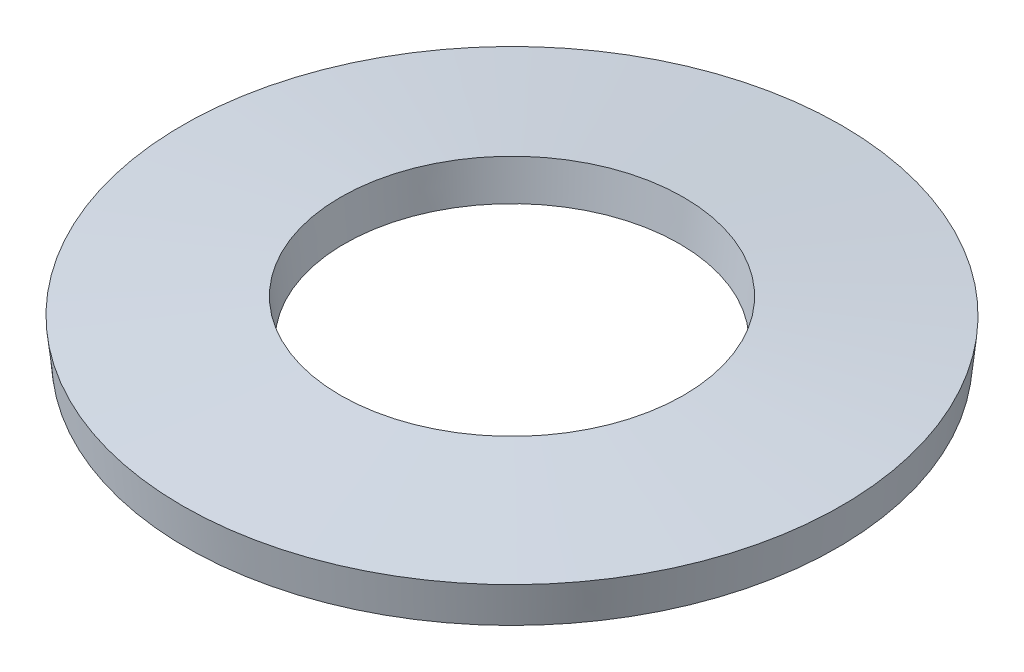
from build123d import *


with BuildPart() as part:
    # Esquisse1 → R_volution1 (revolve)
    with BuildSketch(Plane.XY, mode=Mode.PRIVATE) as r_volution1_sk:
        Polygon((15.617699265, 5), (15.25, 1.519368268), (29.632300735, 0), (30, 3.480631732), align=None)
    revolve(r_volution1_sk.sketch.rotate(Axis((0, 0, 0), (0, 1, 0)), 90), axis=Axis((0, 0, 0), (0, 1, 0)))


solid = part.part
